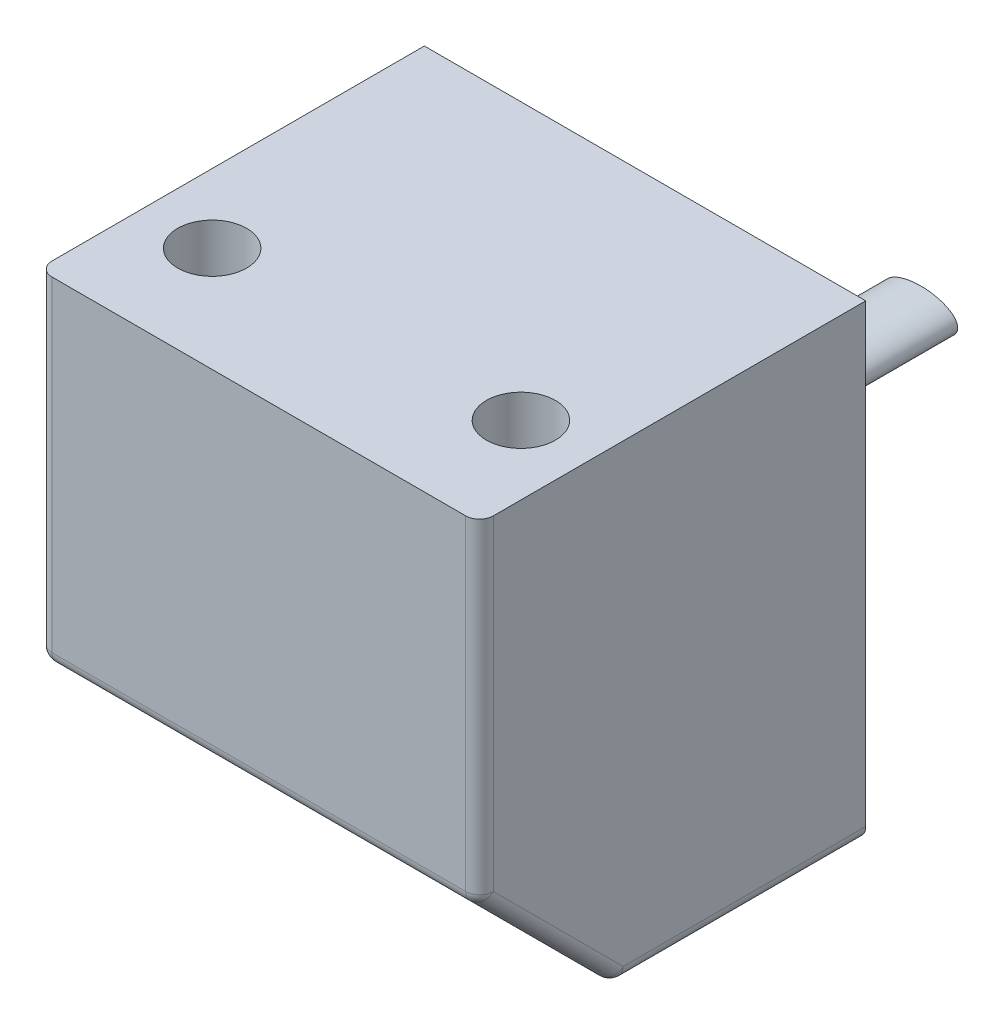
ISO-10303-21;
HEADER;
FILE_DESCRIPTION(('STEP AP214'),'2;1');
FILE_NAME('part.step','',(''),(''),'','','');
FILE_SCHEMA(('AUTOMOTIVE_DESIGN { 1 0 10303 214 1 1 1 1 }'));
ENDSEC;
DATA;
#1=APPLICATION_CONTEXT('core data for automotive mechanical design processes');
#2=APPLICATION_PROTOCOL_DEFINITION('international standard','automotive_design',2000,#1);
#3=PRODUCT_CONTEXT('',#1,'mechanical');
#4=PRODUCT('Part','Part','',(#3));
#5=PRODUCT_RELATED_PRODUCT_CATEGORY('part','',(#4));
#6=PRODUCT_DEFINITION_FORMATION('','',#4);
#7=PRODUCT_DEFINITION_CONTEXT('part definition',#1,'design');
#8=PRODUCT_DEFINITION('design','',#6,#7);
#9=PRODUCT_DEFINITION_SHAPE('','',#8);
#10=(LENGTH_UNIT() NAMED_UNIT(*) SI_UNIT(.MILLI.,.METRE.));
#11=(NAMED_UNIT(*) PLANE_ANGLE_UNIT() SI_UNIT($,.RADIAN.));
#12=(NAMED_UNIT(*) SI_UNIT($,.STERADIAN.) SOLID_ANGLE_UNIT());
#13=UNCERTAINTY_MEASURE_WITH_UNIT(LENGTH_MEASURE(1.E-05),#10,'distance_accuracy_value','');
#14=(GEOMETRIC_REPRESENTATION_CONTEXT(3) GLOBAL_UNCERTAINTY_ASSIGNED_CONTEXT((#13)) GLOBAL_UNIT_ASSIGNED_CONTEXT((#10,
#11,#12)) REPRESENTATION_CONTEXT('',''));
#15=CARTESIAN_POINT('',(0.,0.,0.));
#16=DIRECTION('',(0.,0.,1.));
#17=DIRECTION('',(1.,0.,0.));
#18=AXIS2_PLACEMENT_3D('',#15,#16,#17);
#19=CARTESIAN_POINT('',(0.,17.,0.));
#20=DIRECTION('',(0.,0.,-1.));
#21=DIRECTION('',(-1.,0.,0.));
#22=AXIS2_PLACEMENT_3D('',#19,#20,#21);
#23=PLANE('',#22);
#24=DIRECTION('',(1.,0.,0.));
#25=VECTOR('',#24,1.);
#26=CARTESIAN_POINT('',(0.,0.,0.));
#27=LINE('',#26,#25);
#28=CARTESIAN_POINT('',(0.5,0.,2.22044604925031E-13));
#29=VERTEX_POINT('',#28);
#30=CARTESIAN_POINT('',(15.5,0.,-7.7715611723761E-13));
#31=VERTEX_POINT('',#30);
#32=EDGE_CURVE('E139',#29,#31,#27,.T.);
#33=ORIENTED_EDGE('',*,*,#32,.F.);
#34=CARTESIAN_POINT('',(0.500000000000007,0.5,2.22044604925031E-13));
#35=DIRECTION('',(0.,0.,-1.));
#36=DIRECTION('',(-1.,0.,0.));
#37=AXIS2_PLACEMENT_3D('',#34,#35,#36);
#38=CIRCLE('',#37,0.5);
#39=CARTESIAN_POINT('',(0.,0.5,0.));
#40=VERTEX_POINT('',#39);
#41=EDGE_CURVE('E164',#29,#40,#38,.T.);
#42=ORIENTED_EDGE('',*,*,#41,.T.);
#43=DIRECTION('',(0.,-1.,0.));
#44=VECTOR('',#43,1.);
#45=CARTESIAN_POINT('',(0.,0.,0.));
#46=LINE('',#45,#44);
#47=CARTESIAN_POINT('',(0.,17.,0.));
#48=VERTEX_POINT('',#47);
#49=EDGE_CURVE('E136',#48,#40,#46,.T.);
#50=ORIENTED_EDGE('',*,*,#49,.F.);
#51=DIRECTION('',(-1.,0.,0.));
#52=VECTOR('',#51,1.);
#53=CARTESIAN_POINT('',(0.,17.,0.));
#54=LINE('',#53,#52);
#55=CARTESIAN_POINT('',(16.,17.,1.11022302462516E-13));
#56=VERTEX_POINT('',#55);
#57=EDGE_CURVE('E145',#56,#48,#54,.T.);
#58=ORIENTED_EDGE('',*,*,#57,.F.);
#59=DIRECTION('',(0.,1.,0.));
#60=VECTOR('',#59,1.);
#61=CARTESIAN_POINT('',(16.,0.,1.11022302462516E-13));
#62=LINE('',#61,#60);
#63=CARTESIAN_POINT('',(16.,0.5,1.11022302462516E-13));
#64=VERTEX_POINT('',#63);
#65=EDGE_CURVE('E142',#64,#56,#62,.T.);
#66=ORIENTED_EDGE('',*,*,#65,.F.);
#67=CARTESIAN_POINT('',(15.5,0.5,-7.7715611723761E-13));
#68=DIRECTION('',(0.,0.,-1.));
#69=DIRECTION('',(-1.,0.,0.));
#70=AXIS2_PLACEMENT_3D('',#67,#68,#69);
#71=CIRCLE('',#70,0.5);
#72=EDGE_CURVE('E162',#64,#31,#71,.T.);
#73=ORIENTED_EDGE('',*,*,#72,.T.);
#74=EDGE_LOOP('',(#33,#42,#50,#58,#66,#73));
#75=FACE_BOUND('',#74,.T.);
#76=CARTESIAN_POINT('',(8.00000000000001,7.81528166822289,2.22044604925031E-13));
#77=DIRECTION('',(0.,0.,-1.));
#78=DIRECTION('',(-1.,0.,0.));
#79=AXIS2_PLACEMENT_3D('',#76,#77,#78);
#80=ELLIPSE('',#79,1.33520074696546,0.650482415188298);
#81=CARTESIAN_POINT('',(6.66479925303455,7.81528166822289,2.22046624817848E-13));
#82=VERTEX_POINT('',#81);
#83=EDGE_CURVE('E272',#82,#82,#80,.T.);
#84=ORIENTED_EDGE('',*,*,#83,.F.);
#85=EDGE_LOOP('',(#84));
#86=FACE_BOUND('',#85,.T.);
#87=ADVANCED_FACE('F24',(#75,#86),#23,.T.);
#88=CARTESIAN_POINT('',(0.,0.,13.9999999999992));
#89=DIRECTION('',(1.,0.,0.));
#90=DIRECTION('',(0.,0.,-1.));
#91=AXIS2_PLACEMENT_3D('',#88,#89,#90);
#92=PLANE('',#91);
#93=ORIENTED_EDGE('',*,*,#49,.T.);
#94=DIRECTION('',(0.,0.,-1.));
#95=VECTOR('',#94,1.);
#96=CARTESIAN_POINT('',(0.,0.500000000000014,13.9999999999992));
#97=LINE('',#96,#95);
#98=CARTESIAN_POINT('',(0.,0.500000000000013,8.79289321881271));
#99=VERTEX_POINT('',#98);
#100=EDGE_CURVE('E170',#40,#99,#97,.F.);
#101=ORIENTED_EDGE('',*,*,#100,.T.);
#102=DIRECTION('',(0.,-0.707106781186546,-0.707106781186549));
#103=VECTOR('',#102,1.);
#104=CARTESIAN_POINT('',(0.,5.35355339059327,13.6464466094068));
#105=LINE('',#104,#103);
#106=CARTESIAN_POINT('',(0.,5.20710678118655,13.5));
#107=VERTEX_POINT('',#106);
#108=EDGE_CURVE('E168',#99,#107,#105,.F.);
#109=ORIENTED_EDGE('',*,*,#108,.T.);
#110=DIRECTION('',(0.,-1.,0.));
#111=VECTOR('',#110,1.);
#112=CARTESIAN_POINT('',(0.,0.,13.5));
#113=LINE('',#112,#111);
#114=CARTESIAN_POINT('',(0.,17.,13.5));
#115=VERTEX_POINT('',#114);
#116=EDGE_CURVE('E166',#107,#115,#113,.F.);
#117=ORIENTED_EDGE('',*,*,#116,.T.);
#118=DIRECTION('',(0.,0.,-1.));
#119=VECTOR('',#118,1.);
#120=CARTESIAN_POINT('',(0.,17.,13.9999999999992));
#121=LINE('',#120,#119);
#122=EDGE_CURVE('E151',#115,#48,#121,.T.);
#123=ORIENTED_EDGE('',*,*,#122,.T.);
#124=EDGE_LOOP('',(#93,#101,#109,#117,#123));
#125=FACE_BOUND('',#124,.T.);
#126=ADVANCED_FACE('F26',(#125),#92,.F.);
#127=CARTESIAN_POINT('',(0.,0.,13.9999999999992));
#128=DIRECTION('',(0.,1.,0.));
#129=DIRECTION('',(0.,0.,1.));
#130=AXIS2_PLACEMENT_3D('',#127,#128,#129);
#131=PLANE('',#130);
#132=DIRECTION('',(1.,0.,0.));
#133=VECTOR('',#132,1.);
#134=CARTESIAN_POINT('',(0.,0.,8.79289321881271));
#135=LINE('',#134,#133);
#136=CARTESIAN_POINT('',(15.5,0.,8.79289321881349));
#137=VERTEX_POINT('',#136);
#138=CARTESIAN_POINT('',(0.500000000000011,0.,8.7928932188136));
#139=VERTEX_POINT('',#138);
#140=EDGE_CURVE('E157',#137,#139,#135,.F.);
#141=ORIENTED_EDGE('',*,*,#140,.T.);
#142=DIRECTION('',(0.,0.,-1.));
#143=VECTOR('',#142,1.);
#144=CARTESIAN_POINT('',(0.5,0.,14.0000000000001));
#145=LINE('',#144,#143);
#146=EDGE_CURVE('E159',#139,#29,#145,.T.);
#147=ORIENTED_EDGE('',*,*,#146,.T.);
#148=ORIENTED_EDGE('',*,*,#32,.T.);
#149=DIRECTION('',(0.,0.,-1.));
#150=VECTOR('',#149,1.);
#151=CARTESIAN_POINT('',(15.5,0.,14.0000000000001));
#152=LINE('',#151,#150);
#153=EDGE_CURVE('E155',#31,#137,#152,.F.);
#154=ORIENTED_EDGE('',*,*,#153,.T.);
#155=EDGE_LOOP('',(#141,#147,#148,#154));
#156=FACE_BOUND('',#155,.T.);
#157=ADVANCED_FACE('F334',(#156),#131,.F.);
#158=CARTESIAN_POINT('',(16.,0.,14.));
#159=DIRECTION('',(-1.,0.,0.));
#160=DIRECTION('',(0.,0.,1.));
#161=AXIS2_PLACEMENT_3D('',#158,#159,#160);
#162=PLANE('',#161);
#163=DIRECTION('',(0.,0.707106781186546,0.707106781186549));
#164=VECTOR('',#163,1.);
#165=CARTESIAN_POINT('',(16.,0.353553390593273,8.64644660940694));
#166=LINE('',#165,#164);
#167=CARTESIAN_POINT('',(16.,5.20710678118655,13.5000000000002));
#168=VERTEX_POINT('',#167);
#169=CARTESIAN_POINT('',(16.,0.5,8.7928932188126));
#170=VERTEX_POINT('',#169);
#171=EDGE_CURVE('E39',#168,#170,#166,.F.);
#172=ORIENTED_EDGE('',*,*,#171,.T.);
#173=DIRECTION('',(0.,0.,-1.));
#174=VECTOR('',#173,1.);
#175=CARTESIAN_POINT('',(16.,0.5,14.));
#176=LINE('',#175,#174);
#177=EDGE_CURVE('E189',#170,#64,#176,.T.);
#178=ORIENTED_EDGE('',*,*,#177,.T.);
#179=ORIENTED_EDGE('',*,*,#65,.T.);
#180=DIRECTION('',(0.,0.,-1.));
#181=VECTOR('',#180,1.);
#182=CARTESIAN_POINT('',(16.,17.,13.9999999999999));
#183=LINE('',#182,#181);
#184=CARTESIAN_POINT('',(16.,17.,13.5000000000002));
#185=VERTEX_POINT('',#184);
#186=EDGE_CURVE('E153',#185,#56,#183,.T.);
#187=ORIENTED_EDGE('',*,*,#186,.F.);
#188=DIRECTION('',(0.,1.,0.));
#189=VECTOR('',#188,1.);
#190=CARTESIAN_POINT('',(16.,0.,13.5000000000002));
#191=LINE('',#190,#189);
#192=EDGE_CURVE('E44',#185,#168,#191,.F.);
#193=ORIENTED_EDGE('',*,*,#192,.T.);
#194=EDGE_LOOP('',(#172,#178,#179,#187,#193));
#195=FACE_BOUND('',#194,.T.);
#196=ADVANCED_FACE('F197',(#195),#162,.F.);
#197=CARTESIAN_POINT('',(0.,17.,13.9999999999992));
#198=DIRECTION('',(0.,-1.,0.));
#199=DIRECTION('',(0.,0.,-1.));
#200=AXIS2_PLACEMENT_3D('',#197,#198,#199);
#201=PLANE('',#200);
#202=CARTESIAN_POINT('',(13.5,17.,10.0000000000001));
#203=DIRECTION('',(0.,1.,0.));
#204=DIRECTION('',(0.,0.,1.));
#205=AXIS2_PLACEMENT_3D('',#202,#203,#204);
#206=CIRCLE('',#205,1.24999999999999);
#207=CARTESIAN_POINT('',(13.5,17.,11.2500000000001));
#208=VERTEX_POINT('',#207);
#209=EDGE_CURVE('E120',#208,#208,#206,.T.);
#210=ORIENTED_EDGE('',*,*,#209,.F.);
#211=EDGE_LOOP('',(#210));
#212=FACE_BOUND('',#211,.T.);
#213=CARTESIAN_POINT('',(2.50170970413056,17.,10.1939344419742));
#214=DIRECTION('',(0.,1.,0.));
#215=DIRECTION('',(0.,0.,1.));
#216=AXIS2_PLACEMENT_3D('',#213,#214,#215);
#217=CIRCLE('',#216,1.24999999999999);
#218=CARTESIAN_POINT('',(2.50170970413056,17.,11.4439344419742));
#219=VERTEX_POINT('',#218);
#220=EDGE_CURVE('E133',#219,#219,#217,.T.);
#221=ORIENTED_EDGE('',*,*,#220,.F.);
#222=EDGE_LOOP('',(#221));
#223=FACE_BOUND('',#222,.T.);
#224=ORIENTED_EDGE('',*,*,#122,.F.);
#225=CARTESIAN_POINT('',(0.500000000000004,17.,13.5000000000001));
#226=DIRECTION('',(0.,-1.,0.));
#227=DIRECTION('',(0.,0.,-1.));
#228=AXIS2_PLACEMENT_3D('',#225,#226,#227);
#229=CIRCLE('',#228,0.5);
#230=CARTESIAN_POINT('',(0.5,17.,14.0000000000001));
#231=VERTEX_POINT('',#230);
#232=EDGE_CURVE('E11',#115,#231,#229,.F.);
#233=ORIENTED_EDGE('',*,*,#232,.T.);
#234=DIRECTION('',(-1.,0.,0.));
#235=VECTOR('',#234,1.);
#236=CARTESIAN_POINT('',(0.,17.,13.9999999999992));
#237=LINE('',#236,#235);
#238=CARTESIAN_POINT('',(15.5,17.,14.0000000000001));
#239=VERTEX_POINT('',#238);
#240=EDGE_CURVE('E148',#239,#231,#237,.T.);
#241=ORIENTED_EDGE('',*,*,#240,.F.);
#242=CARTESIAN_POINT('',(15.5,17.,13.4999999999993));
#243=DIRECTION('',(0.,-1.,0.));
#244=DIRECTION('',(0.,0.,-1.));
#245=AXIS2_PLACEMENT_3D('',#242,#243,#244);
#246=CIRCLE('',#245,0.5);
#247=EDGE_CURVE('E32',#239,#185,#246,.F.);
#248=ORIENTED_EDGE('',*,*,#247,.T.);
#249=ORIENTED_EDGE('',*,*,#186,.T.);
#250=ORIENTED_EDGE('',*,*,#57,.T.);
#251=EDGE_LOOP('',(#224,#233,#241,#248,#249,#250));
#252=FACE_BOUND('',#251,.T.);
#253=ADVANCED_FACE('F194',(#212,#223,#252),#201,.F.);
#254=CARTESIAN_POINT('',(0.,17.,13.9999999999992));
#255=DIRECTION('',(0.,0.,-1.));
#256=DIRECTION('',(-1.,0.,0.));
#257=AXIS2_PLACEMENT_3D('',#254,#255,#256);
#258=PLANE('',#257);
#259=ORIENTED_EDGE('',*,*,#240,.T.);
#260=DIRECTION('',(0.,-1.,0.));
#261=VECTOR('',#260,1.);
#262=CARTESIAN_POINT('',(0.5,17.,14.0000000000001));
#263=LINE('',#262,#261);
#264=CARTESIAN_POINT('',(0.500000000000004,5.20710678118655,14.0000000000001));
#265=VERTEX_POINT('',#264);
#266=EDGE_CURVE('E185',#231,#265,#263,.T.);
#267=ORIENTED_EDGE('',*,*,#266,.T.);
#268=DIRECTION('',(-1.,0.,0.));
#269=VECTOR('',#268,1.);
#270=CARTESIAN_POINT('',(16.,5.20710678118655,14.));
#271=LINE('',#270,#269);
#272=CARTESIAN_POINT('',(15.5,5.20710678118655,14.0000000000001));
#273=VERTEX_POINT('',#272);
#274=EDGE_CURVE('E183',#265,#273,#271,.F.);
#275=ORIENTED_EDGE('',*,*,#274,.T.);
#276=DIRECTION('',(0.,1.,0.));
#277=VECTOR('',#276,1.);
#278=CARTESIAN_POINT('',(15.5,17.,14.0000000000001));
#279=LINE('',#278,#277);
#280=EDGE_CURVE('E181',#273,#239,#279,.T.);
#281=ORIENTED_EDGE('',*,*,#280,.T.);
#282=EDGE_LOOP('',(#259,#267,#275,#281));
#283=FACE_BOUND('',#282,.T.);
#284=ADVANCED_FACE('F322',(#283),#258,.F.);
#285=CARTESIAN_POINT('',(2.50170970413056,17.,10.1939344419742));
#286=DIRECTION('',(0.,1.,0.));
#287=DIRECTION('',(0.,0.,1.));
#288=AXIS2_PLACEMENT_3D('',#285,#286,#287);
#289=CYLINDRICAL_SURFACE('',#288,1.24999999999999);
#290=CARTESIAN_POINT('',(2.50170970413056,11.5,10.1939344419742));
#291=DIRECTION('',(0.,1.,0.));
#292=DIRECTION('',(0.,0.,1.));
#293=AXIS2_PLACEMENT_3D('',#290,#291,#292);
#294=CIRCLE('',#293,1.25);
#295=CARTESIAN_POINT('',(2.50170970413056,11.5,11.4439344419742));
#296=VERTEX_POINT('',#295);
#297=EDGE_CURVE('E124',#296,#296,#294,.T.);
#298=ORIENTED_EDGE('',*,*,#297,.F.);
#299=EDGE_LOOP('',(#298));
#300=FACE_BOUND('',#299,.T.);
#301=ORIENTED_EDGE('',*,*,#220,.T.);
#302=EDGE_LOOP('',(#301));
#303=FACE_BOUND('',#302,.T.);
#304=ADVANCED_FACE('F318',(#300,#303),#289,.F.);
#305=CARTESIAN_POINT('',(2.50170970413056,11.5,10.1939344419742));
#306=DIRECTION('',(0.,1.,0.));
#307=DIRECTION('',(0.,0.,1.));
#308=AXIS2_PLACEMENT_3D('',#305,#306,#307);
#309=CONICAL_SURFACE('',#308,1.25,1.02974425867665);
#310=CARTESIAN_POINT('',(2.50170970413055,10.7489242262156,10.1939344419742));
#311=VERTEX_POINT('',#310);
#312=VERTEX_LOOP('',#311);
#313=FACE_BOUND('',#312,.T.);
#314=ORIENTED_EDGE('',*,*,#297,.T.);
#315=EDGE_LOOP('',(#314));
#316=FACE_BOUND('',#315,.T.);
#317=ADVANCED_FACE('F315',(#313,#316),#309,.F.);
#318=CARTESIAN_POINT('',(13.5,17.,10.0000000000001));
#319=DIRECTION('',(0.,1.,0.));
#320=DIRECTION('',(0.,0.,1.));
#321=AXIS2_PLACEMENT_3D('',#318,#319,#320);
#322=CYLINDRICAL_SURFACE('',#321,1.24999999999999);
#323=CARTESIAN_POINT('',(13.5,11.5,10.0000000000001));
#324=DIRECTION('',(0.,1.,0.));
#325=DIRECTION('',(0.,0.,1.));
#326=AXIS2_PLACEMENT_3D('',#323,#324,#325);
#327=CIRCLE('',#326,1.25);
#328=CARTESIAN_POINT('',(13.5,11.5,11.2500000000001));
#329=VERTEX_POINT('',#328);
#330=EDGE_CURVE('E118',#329,#329,#327,.T.);
#331=ORIENTED_EDGE('',*,*,#330,.F.);
#332=EDGE_LOOP('',(#331));
#333=FACE_BOUND('',#332,.T.);
#334=ORIENTED_EDGE('',*,*,#209,.T.);
#335=EDGE_LOOP('',(#334));
#336=FACE_BOUND('',#335,.T.);
#337=ADVANCED_FACE('F114',(#333,#336),#322,.F.);
#338=CARTESIAN_POINT('',(13.5,11.5,10.0000000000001));
#339=DIRECTION('',(0.,1.,0.));
#340=DIRECTION('',(0.,0.,1.));
#341=AXIS2_PLACEMENT_3D('',#338,#339,#340);
#342=CONICAL_SURFACE('',#341,1.25,1.02974425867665);
#343=CARTESIAN_POINT('',(13.5,10.7489242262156,10.0000000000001));
#344=VERTEX_POINT('',#343);
#345=VERTEX_LOOP('',#344);
#346=FACE_BOUND('',#345,.T.);
#347=ORIENTED_EDGE('',*,*,#330,.T.);
#348=EDGE_LOOP('',(#347));
#349=FACE_BOUND('',#348,.T.);
#350=ADVANCED_FACE('F110',(#346,#349),#342,.F.);
#351=CARTESIAN_POINT('',(0.,5.,13.9999999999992));
#352=DIRECTION('',(0.,0.707106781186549,-0.707106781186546));
#353=DIRECTION('',(0.,0.707106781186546,0.707106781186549));
#354=AXIS2_PLACEMENT_3D('',#351,#352,#353);
#355=PLANE('',#354);
#356=DIRECTION('',(0.,0.707106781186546,0.707106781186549));
#357=VECTOR('',#356,1.);
#358=CARTESIAN_POINT('',(0.500000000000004,0.,9.00000000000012));
#359=LINE('',#358,#357);
#360=CARTESIAN_POINT('',(0.499999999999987,4.85355339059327,13.8535533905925));
#361=VERTEX_POINT('',#360);
#362=CARTESIAN_POINT('',(0.500000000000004,0.146446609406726,9.14644660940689));
#363=VERTEX_POINT('',#362);
#364=EDGE_CURVE('E176',#361,#363,#359,.F.);
#365=ORIENTED_EDGE('',*,*,#364,.T.);
#366=DIRECTION('',(-1.,0.,0.));
#367=VECTOR('',#366,1.);
#368=CARTESIAN_POINT('',(16.,0.146446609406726,9.14644660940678));
#369=LINE('',#368,#367);
#370=CARTESIAN_POINT('',(15.5,0.146446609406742,9.14644660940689));
#371=VERTEX_POINT('',#370);
#372=EDGE_CURVE('E178',#363,#371,#369,.F.);
#373=ORIENTED_EDGE('',*,*,#372,.T.);
#374=DIRECTION('',(0.,-0.707106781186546,-0.707106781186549));
#375=VECTOR('',#374,1.);
#376=CARTESIAN_POINT('',(15.5,5.,14.0000000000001));
#377=LINE('',#376,#375);
#378=CARTESIAN_POINT('',(15.5,4.85355339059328,13.8535533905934));
#379=VERTEX_POINT('',#378);
#380=EDGE_CURVE('E172',#371,#379,#377,.F.);
#381=ORIENTED_EDGE('',*,*,#380,.T.);
#382=DIRECTION('',(1.,0.,0.));
#383=VECTOR('',#382,1.);
#384=CARTESIAN_POINT('',(0.,4.85355339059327,13.8535533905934));
#385=LINE('',#384,#383);
#386=EDGE_CURVE('E174',#379,#361,#385,.F.);
#387=ORIENTED_EDGE('',*,*,#386,.T.);
#388=EDGE_LOOP('',(#365,#373,#381,#387));
#389=FACE_BOUND('',#388,.T.);
#390=ADVANCED_FACE('F113',(#389),#355,.F.);
#391=CARTESIAN_POINT('',(15.5,17.,13.4999999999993));
#392=DIRECTION('',(0.,1.,0.));
#393=DIRECTION('',(0.,0.,1.));
#394=AXIS2_PLACEMENT_3D('',#391,#392,#393);
#395=CYLINDRICAL_SURFACE('',#394,0.5);
#396=CARTESIAN_POINT('',(15.5,5.20710678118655,13.4999999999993));
#397=DIRECTION('',(0.,-1.,0.));
#398=DIRECTION('',(0.,0.,-1.));
#399=AXIS2_PLACEMENT_3D('',#396,#397,#398);
#400=CIRCLE('',#399,0.5);
#401=EDGE_CURVE('E121',#168,#273,#400,.T.);
#402=ORIENTED_EDGE('',*,*,#401,.F.);
#403=ORIENTED_EDGE('',*,*,#192,.F.);
#404=ORIENTED_EDGE('',*,*,#247,.F.);
#405=ORIENTED_EDGE('',*,*,#280,.F.);
#406=EDGE_LOOP('',(#402,#403,#404,#405));
#407=FACE_BOUND('',#406,.T.);
#408=ADVANCED_FACE('F200',(#407),#395,.T.);
#409=CARTESIAN_POINT('',(15.5,5.20710678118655,13.4999999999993));
#410=DIRECTION('',(0.,0.,1.));
#411=DIRECTION('',(1.,0.,0.));
#412=AXIS2_PLACEMENT_3D('',#409,#410,#411);
#413=SPHERICAL_SURFACE('',#412,0.5);
#414=CARTESIAN_POINT('',(15.5,5.20710678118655,13.4999999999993));
#415=DIRECTION('',(0.,0.707106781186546,0.707106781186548));
#416=DIRECTION('',(0.,-0.707106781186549,0.707106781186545));
#417=AXIS2_PLACEMENT_3D('',#414,#415,#416);
#418=CIRCLE('',#417,0.5);
#419=EDGE_CURVE('E206',#168,#379,#418,.F.);
#420=ORIENTED_EDGE('',*,*,#419,.F.);
#421=ORIENTED_EDGE('',*,*,#401,.T.);
#422=CARTESIAN_POINT('',(15.5,5.20710678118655,13.4999999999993));
#423=DIRECTION('',(1.,0.,0.));
#424=DIRECTION('',(0.,0.,-1.));
#425=AXIS2_PLACEMENT_3D('',#422,#423,#424);
#426=CIRCLE('',#425,0.5);
#427=EDGE_CURVE('E127',#379,#273,#426,.F.);
#428=ORIENTED_EDGE('',*,*,#427,.F.);
#429=EDGE_LOOP('',(#420,#421,#428));
#430=FACE_BOUND('',#429,.T.);
#431=ADVANCED_FACE('F207',(#430),#413,.T.);
#432=CARTESIAN_POINT('',(0.500000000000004,17.,13.5000000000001));
#433=DIRECTION('',(0.,-1.,0.));
#434=DIRECTION('',(0.,0.,-1.));
#435=AXIS2_PLACEMENT_3D('',#432,#433,#434);
#436=CYLINDRICAL_SURFACE('',#435,0.5);
#437=ORIENTED_EDGE('',*,*,#232,.F.);
#438=ORIENTED_EDGE('',*,*,#116,.F.);
#439=CARTESIAN_POINT('',(0.499999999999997,5.20710678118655,13.5000000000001));
#440=DIRECTION('',(0.,-1.,0.));
#441=DIRECTION('',(1.,0.,0.));
#442=AXIS2_PLACEMENT_3D('',#439,#440,#441);
#443=CIRCLE('',#442,0.5);
#444=EDGE_CURVE('E211',#265,#107,#443,.T.);
#445=ORIENTED_EDGE('',*,*,#444,.F.);
#446=ORIENTED_EDGE('',*,*,#266,.F.);
#447=EDGE_LOOP('',(#437,#438,#445,#446));
#448=FACE_BOUND('',#447,.T.);
#449=ADVANCED_FACE('F303',(#448),#436,.T.);
#450=CARTESIAN_POINT('',(0.,5.20710678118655,13.5));
#451=DIRECTION('',(1.,0.,0.));
#452=DIRECTION('',(0.,0.,-1.));
#453=AXIS2_PLACEMENT_3D('',#450,#451,#452);
#454=CYLINDRICAL_SURFACE('',#453,0.5);
#455=ORIENTED_EDGE('',*,*,#427,.T.);
#456=ORIENTED_EDGE('',*,*,#274,.F.);
#457=CARTESIAN_POINT('',(0.499999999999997,5.20710678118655,13.5000000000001));
#458=DIRECTION('',(-1.,0.,0.));
#459=DIRECTION('',(0.,0.,1.));
#460=AXIS2_PLACEMENT_3D('',#457,#458,#459);
#461=CIRCLE('',#460,0.5);
#462=EDGE_CURVE('E220',#361,#265,#461,.T.);
#463=ORIENTED_EDGE('',*,*,#462,.F.);
#464=ORIENTED_EDGE('',*,*,#386,.F.);
#465=EDGE_LOOP('',(#455,#456,#463,#464));
#466=FACE_BOUND('',#465,.T.);
#467=ADVANCED_FACE('F240',(#466),#454,.T.);
#468=CARTESIAN_POINT('',(15.5,2.85355339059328,11.1464466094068));
#469=DIRECTION('',(0.,-0.707106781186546,-0.707106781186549));
#470=DIRECTION('',(0.,0.707106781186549,-0.707106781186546));
#471=AXIS2_PLACEMENT_3D('',#468,#469,#470);
#472=CYLINDRICAL_SURFACE('',#471,0.5);
#473=ORIENTED_EDGE('',*,*,#419,.T.);
#474=ORIENTED_EDGE('',*,*,#380,.F.);
#475=CARTESIAN_POINT('',(15.5,0.5,8.79289321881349));
#476=DIRECTION('',(0.,-0.707106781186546,-0.707106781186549));
#477=DIRECTION('',(0.,0.707106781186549,-0.707106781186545));
#478=AXIS2_PLACEMENT_3D('',#475,#476,#477);
#479=CIRCLE('',#478,0.5);
#480=EDGE_CURVE('E216',#170,#371,#479,.T.);
#481=ORIENTED_EDGE('',*,*,#480,.F.);
#482=ORIENTED_EDGE('',*,*,#171,.F.);
#483=EDGE_LOOP('',(#473,#474,#481,#482));
#484=FACE_BOUND('',#483,.T.);
#485=ADVANCED_FACE('F214',(#484),#472,.T.);
#486=CARTESIAN_POINT('',(15.5,0.5,14.0000000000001));
#487=DIRECTION('',(0.,0.,-1.));
#488=DIRECTION('',(-1.,0.,0.));
#489=AXIS2_PLACEMENT_3D('',#486,#487,#488);
#490=CYLINDRICAL_SURFACE('',#489,0.5);
#491=ORIENTED_EDGE('',*,*,#72,.F.);
#492=ORIENTED_EDGE('',*,*,#177,.F.);
#493=CARTESIAN_POINT('',(15.5,0.5,8.79289321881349));
#494=DIRECTION('',(0.,0.,1.));
#495=DIRECTION('',(1.,0.,0.));
#496=AXIS2_PLACEMENT_3D('',#493,#494,#495);
#497=CIRCLE('',#496,0.5);
#498=EDGE_CURVE('E221',#137,#170,#497,.T.);
#499=ORIENTED_EDGE('',*,*,#498,.F.);
#500=ORIENTED_EDGE('',*,*,#153,.F.);
#501=EDGE_LOOP('',(#491,#492,#499,#500));
#502=FACE_BOUND('',#501,.T.);
#503=ADVANCED_FACE('F295',(#502),#490,.T.);
#504=CARTESIAN_POINT('',(0.499999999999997,5.20710678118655,13.5000000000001));
#505=DIRECTION('',(0.,0.,1.));
#506=DIRECTION('',(1.,0.,0.));
#507=AXIS2_PLACEMENT_3D('',#504,#505,#506);
#508=SPHERICAL_SURFACE('',#507,0.5);
#509=ORIENTED_EDGE('',*,*,#462,.T.);
#510=ORIENTED_EDGE('',*,*,#444,.T.);
#511=CARTESIAN_POINT('',(0.499999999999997,5.20710678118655,13.5000000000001));
#512=DIRECTION('',(0.,0.707106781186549,0.707106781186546));
#513=DIRECTION('',(0.,-0.707106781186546,0.707106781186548));
#514=AXIS2_PLACEMENT_3D('',#511,#512,#513);
#515=CIRCLE('',#514,0.5);
#516=EDGE_CURVE('E229',#361,#107,#515,.F.);
#517=ORIENTED_EDGE('',*,*,#516,.F.);
#518=EDGE_LOOP('',(#509,#510,#517));
#519=FACE_BOUND('',#518,.T.);
#520=ADVANCED_FACE('F292',(#519),#508,.T.);
#521=CARTESIAN_POINT('',(15.5,0.5,8.79289321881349));
#522=DIRECTION('',(0.,0.,1.));
#523=DIRECTION('',(1.,0.,0.));
#524=AXIS2_PLACEMENT_3D('',#521,#522,#523);
#525=SPHERICAL_SURFACE('',#524,0.5);
#526=ORIENTED_EDGE('',*,*,#498,.T.);
#527=ORIENTED_EDGE('',*,*,#480,.T.);
#528=CARTESIAN_POINT('',(15.5,0.500000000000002,8.79289321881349));
#529=DIRECTION('',(1.,0.,0.));
#530=DIRECTION('',(0.,0.,-1.));
#531=AXIS2_PLACEMENT_3D('',#528,#529,#530);
#532=CIRCLE('',#531,0.5);
#533=EDGE_CURVE('E225',#137,#371,#532,.F.);
#534=ORIENTED_EDGE('',*,*,#533,.F.);
#535=EDGE_LOOP('',(#526,#527,#534));
#536=FACE_BOUND('',#535,.T.);
#537=ADVANCED_FACE('F224',(#536),#525,.T.);
#538=CARTESIAN_POINT('',(0.5,2.85355339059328,11.1464466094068));
#539=DIRECTION('',(0.,0.707106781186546,0.707106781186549));
#540=DIRECTION('',(0.,-0.707106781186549,0.707106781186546));
#541=AXIS2_PLACEMENT_3D('',#538,#539,#540);
#542=CYLINDRICAL_SURFACE('',#541,0.5);
#543=ORIENTED_EDGE('',*,*,#516,.T.);
#544=ORIENTED_EDGE('',*,*,#108,.F.);
#545=CARTESIAN_POINT('',(0.5,0.5,8.7928932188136));
#546=DIRECTION('',(0.,-0.707106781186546,-0.707106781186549));
#547=DIRECTION('',(0.,0.707106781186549,-0.707106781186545));
#548=AXIS2_PLACEMENT_3D('',#545,#546,#547);
#549=CIRCLE('',#548,0.5);
#550=EDGE_CURVE('E257',#363,#99,#549,.T.);
#551=ORIENTED_EDGE('',*,*,#550,.F.);
#552=ORIENTED_EDGE('',*,*,#364,.F.);
#553=EDGE_LOOP('',(#543,#544,#551,#552));
#554=FACE_BOUND('',#553,.T.);
#555=ADVANCED_FACE('F258',(#554),#542,.T.);
#556=CARTESIAN_POINT('',(0.,0.500000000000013,8.79289321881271));
#557=DIRECTION('',(-1.,0.,0.));
#558=DIRECTION('',(0.,0.,1.));
#559=AXIS2_PLACEMENT_3D('',#556,#557,#558);
#560=CYLINDRICAL_SURFACE('',#559,0.5);
#561=ORIENTED_EDGE('',*,*,#533,.T.);
#562=ORIENTED_EDGE('',*,*,#372,.F.);
#563=CARTESIAN_POINT('',(0.5,0.5,8.7928932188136));
#564=DIRECTION('',(-1.,0.,0.));
#565=DIRECTION('',(0.,0.,1.));
#566=AXIS2_PLACEMENT_3D('',#563,#564,#565);
#567=CIRCLE('',#566,0.5);
#568=EDGE_CURVE('E252',#139,#363,#567,.T.);
#569=ORIENTED_EDGE('',*,*,#568,.F.);
#570=ORIENTED_EDGE('',*,*,#140,.F.);
#571=EDGE_LOOP('',(#561,#562,#569,#570));
#572=FACE_BOUND('',#571,.T.);
#573=ADVANCED_FACE('F250',(#572),#560,.T.);
#574=CARTESIAN_POINT('',(0.5,0.5,8.7928932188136));
#575=DIRECTION('',(0.,0.,1.));
#576=DIRECTION('',(1.,0.,0.));
#577=AXIS2_PLACEMENT_3D('',#574,#575,#576);
#578=SPHERICAL_SURFACE('',#577,0.5);
#579=ORIENTED_EDGE('',*,*,#568,.T.);
#580=ORIENTED_EDGE('',*,*,#550,.T.);
#581=CARTESIAN_POINT('',(0.5,0.5,8.7928932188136));
#582=DIRECTION('',(0.,0.,1.));
#583=DIRECTION('',(1.,0.,0.));
#584=AXIS2_PLACEMENT_3D('',#581,#582,#583);
#585=CIRCLE('',#584,0.5);
#586=EDGE_CURVE('E263',#139,#99,#585,.F.);
#587=ORIENTED_EDGE('',*,*,#586,.F.);
#588=EDGE_LOOP('',(#579,#580,#587));
#589=FACE_BOUND('',#588,.T.);
#590=ADVANCED_FACE('F262',(#589),#578,.T.);
#591=CARTESIAN_POINT('',(0.500000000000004,0.500000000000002,14.0000000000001));
#592=DIRECTION('',(0.,0.,-1.));
#593=DIRECTION('',(-1.,0.,0.));
#594=AXIS2_PLACEMENT_3D('',#591,#592,#593);
#595=CYLINDRICAL_SURFACE('',#594,0.5);
#596=ORIENTED_EDGE('',*,*,#586,.T.);
#597=ORIENTED_EDGE('',*,*,#100,.F.);
#598=ORIENTED_EDGE('',*,*,#41,.F.);
#599=ORIENTED_EDGE('',*,*,#146,.F.);
#600=EDGE_LOOP('',(#596,#597,#598,#599));
#601=FACE_BOUND('',#600,.T.);
#602=ADVANCED_FACE('F279',(#601),#595,.T.);
#603=CARTESIAN_POINT('',(8.,7.81528166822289,-9.9999999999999));
#604=DIRECTION('',(0.,0.,-1.));
#605=DIRECTION('',(-1.,0.,0.));
#606=AXIS2_PLACEMENT_3D('',#603,#604,#605);
#607=ELLIPSE('',#606,1.33520074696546,0.650482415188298);
#608=DIRECTION('',(0.,0.,1.));
#609=VECTOR('',#608,1.);
#610=SURFACE_OF_LINEAR_EXTRUSION('',#607,#609);
#611=CARTESIAN_POINT('',(6.66479925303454,7.81528166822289,-9.9999999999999));
#612=VERTEX_POINT('',#611);
#613=EDGE_CURVE('E266',#612,#612,#607,.T.);
#614=ORIENTED_EDGE('',*,*,#613,.F.);
#615=EDGE_LOOP('',(#614));
#616=FACE_BOUND('',#615,.T.);
#617=ORIENTED_EDGE('',*,*,#83,.T.);
#618=EDGE_LOOP('',(#617));
#619=FACE_BOUND('',#618,.T.);
#620=ADVANCED_FACE('F274',(#616,#619),#610,.F.);
#621=CARTESIAN_POINT('',(8.,7.81528166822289,-9.9999999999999));
#622=DIRECTION('',(0.,0.,-1.));
#623=DIRECTION('',(-1.,0.,0.));
#624=AXIS2_PLACEMENT_3D('',#621,#622,#623);
#625=PLANE('',#624);
#626=ORIENTED_EDGE('',*,*,#613,.T.);
#627=EDGE_LOOP('',(#626));
#628=FACE_BOUND('',#627,.T.);
#629=ADVANCED_FACE('F278',(#628),#625,.T.);
#630=CLOSED_SHELL('',(#87,#126,#157,#196,#253,#284,#304,#317,#337,#350,#390,#408,#431,#449,#467,
#485,#503,#520,#537,#555,#573,#590,#602,#620,#629));
#631=MANIFOLD_SOLID_BREP('B2',#630);
#632=ADVANCED_BREP_SHAPE_REPRESENTATION('',(#18,#631),#14);
#633=SHAPE_DEFINITION_REPRESENTATION(#9,#632);
ENDSEC;
END-ISO-10303-21;
